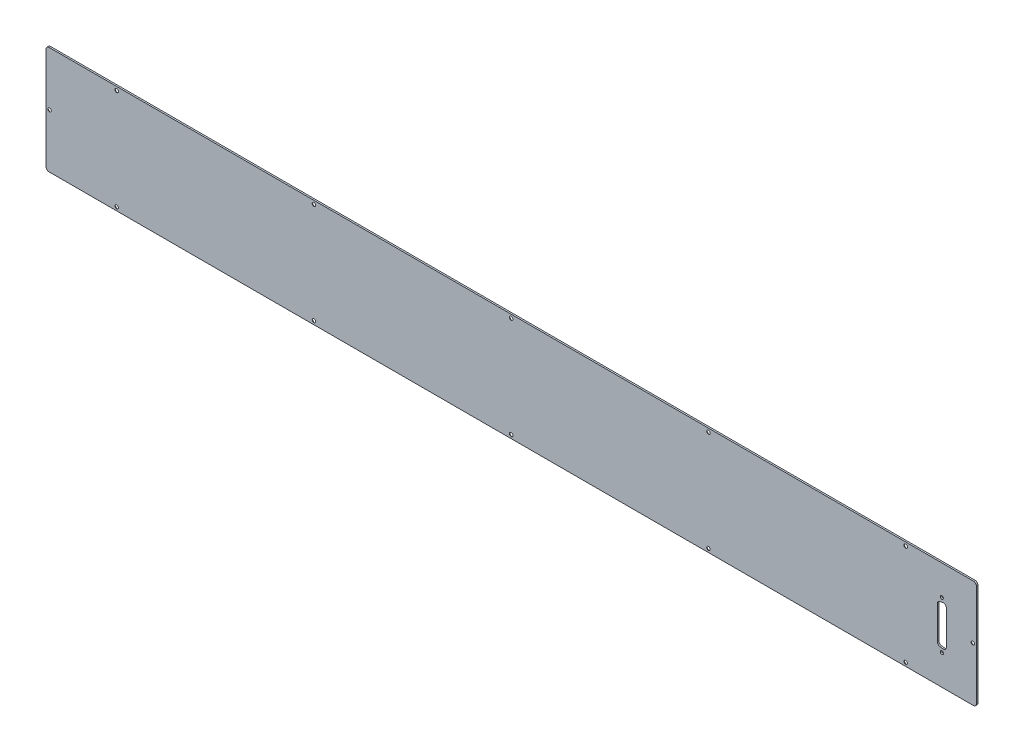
from build123d import *

# Parameters (mm, degrees)
SKETCH1_W                                      = 915
SKETCH1_H                                      = 106
BOSS_EXTRUDE1_DEPTH                            = 1.5748
FILLET1_R                                      = 3
CSK_FOR_M3_FLAT_HEAD_MACHINE_SCREW1_AT_2_COUNT = 2
CSK_FOR_M3_FLAT_HEAD_MACHINE_SCREW1_AT_2_PITCH = 194
CSK_FOR_M3_FLAT_HEAD_MACHINE_SCREW1_AT_3_COUNT = 2
CSK_FOR_M3_FLAT_HEAD_MACHINE_SCREW1_AT_3_PITCH = 388
CSK_FOR_M3_FLAT_HEAD_MACHINE_SCREW1_AT_4_COUNT = 2
CSK_FOR_M3_FLAT_HEAD_MACHINE_SCREW1_AT_4_PITCH = 217.800367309
CSK_FOR_M3_FLAT_HEAD_MACHINE_SCREW1_AT_5_COUNT = 2
CSK_FOR_M3_FLAT_HEAD_MACHINE_SCREW1_AT_5_PITCH = 99
CSK_FOR_M3_FLAT_HEAD_MACHINE_SCREW1_AT_6_COUNT = 2
CSK_FOR_M3_FLAT_HEAD_MACHINE_SCREW1_AT_6_PITCH = 400.43101778
CSK_FOR_M3_FLAT_HEAD_MACHINE_SCREW1_AT_7_COUNT = 2
CSK_FOR_M3_FLAT_HEAD_MACHINE_SCREW1_AT_7_PITCH = 782.289588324
CSK_FOR_M3_FLAT_HEAD_MACHINE_SCREW1_AT_8_COUNT = 2
CSK_FOR_M3_FLAT_HEAD_MACHINE_SCREW1_AT_8_PITCH = 776
CSK_FOR_M3_FLAT_HEAD_MACHINE_SCREW1_AT_9_COUNT = 2
CSK_FOR_M3_FLAT_HEAD_MACHINE_SCREW1_AT_9_PITCH = 582
CSK_FOR_M3_FLAT_HEAD_MACHINE_SCREW1_AT_1_COUNT = 2
CSK_FOR_M3_FLAT_HEAD_MACHINE_SCREW1_AT_1_PITCH = 590.360059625
CSK_FOR_M3_FLAT_HEAD_MACHINE_SCREW1_2_COUNT    = 2
CSK_FOR_M3_FLAT_HEAD_MACHINE_SCREW1_2_PITCH    = 82.5
CSK_FOR_M3_FLAT_HEAD_MACHINE_SCREW1_3_COUNT    = 2
CSK_FOR_M3_FLAT_HEAD_MACHINE_SCREW1_3_PITCH    = 843.453762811
SKETCH9_R                                      = 1.55
CUT_EXTRUDE1_DEPTH                             = 461.562406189


with BuildPart() as part:
    # Sketch1 → Boss-Extrude1 (new body)
    with BuildSketch(Plane.XY):
        Rectangle(SKETCH1_W, SKETCH1_H)
    extrude(amount=BOSS_EXTRUDE1_DEPTH)

    # Fillet1
    fillet1_edges = [part.edges().sort_by_distance(p)[0] for p in [
        (457.5, -53, 0.7874),
        (-457.5, -53, 0.7874),
        (-457.5, 53, 0.7874),
        (457.5, 53, 0.7874),
    ]]
    fillet(fillet1_edges, radius=FILLET1_R)

    # Sketch4 → CSK for M3 Flat Head Machine Screw1 (revolve, cut)
    with BuildSketch(Plane(origin=(-388, 49.5, 0), x_dir=(0, 1, 0), z_dir=(1, 0, 0))):
        Polygon((0, 0), (0, 1.5748), (1.7, 1.5748), (1.7, 1.45), (3.15, 0), align=None)
    csk_for_m3_flat_head_machine_screw1 = revolve(axis=Axis((-388, 49.5, -6.35), (0, 0, 1)), mode=Mode.SUBTRACT)

    # CSK for M3 Flat Head Machine Screw1 at 2: CSK for M3 Flat Head Machine Screw1 ×2
    with Locations(*[(i * CSK_FOR_M3_FLAT_HEAD_MACHINE_SCREW1_AT_2_PITCH, 0, 0) for i in range(1, CSK_FOR_M3_FLAT_HEAD_MACHINE_SCREW1_AT_2_COUNT)]):
        add(csk_for_m3_flat_head_machine_screw1, mode=Mode.SUBTRACT)

    # CSK for M3 Flat Head Machine Screw1 at 3: CSK for M3 Flat Head Machine Screw1 ×2
    with Locations(*[(i * CSK_FOR_M3_FLAT_HEAD_MACHINE_SCREW1_AT_3_PITCH, 0, 0) for i in range(1, CSK_FOR_M3_FLAT_HEAD_MACHINE_SCREW1_AT_3_COUNT)]):
        add(csk_for_m3_flat_head_machine_screw1, mode=Mode.SUBTRACT)

    # CSK for M3 Flat Head Machine Screw1 at 4: CSK for M3 Flat Head Machine Screw1 ×2
    with Locations(*[Vector(0.8907239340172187, -0.4545446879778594, 0) * (i * CSK_FOR_M3_FLAT_HEAD_MACHINE_SCREW1_AT_4_PITCH) for i in range(1, CSK_FOR_M3_FLAT_HEAD_MACHINE_SCREW1_AT_4_COUNT)]):
        add(csk_for_m3_flat_head_machine_screw1, mode=Mode.SUBTRACT)

    # CSK for M3 Flat Head Machine Screw1 at 5: CSK for M3 Flat Head Machine Screw1 ×2
    with Locations(*[(0, -i * CSK_FOR_M3_FLAT_HEAD_MACHINE_SCREW1_AT_5_PITCH, 0) for i in range(1, CSK_FOR_M3_FLAT_HEAD_MACHINE_SCREW1_AT_5_COUNT)]):
        add(csk_for_m3_flat_head_machine_screw1, mode=Mode.SUBTRACT)

    # CSK for M3 Flat Head Machine Screw1 at 6: CSK for M3 Flat Head Machine Screw1 ×2
    with Locations(*[Vector(0.968955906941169, -0.2472335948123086, 0) * (i * CSK_FOR_M3_FLAT_HEAD_MACHINE_SCREW1_AT_6_PITCH) for i in range(1, CSK_FOR_M3_FLAT_HEAD_MACHINE_SCREW1_AT_6_COUNT)]):
        add(csk_for_m3_flat_head_machine_screw1, mode=Mode.SUBTRACT)

    # CSK for M3 Flat Head Machine Screw1 at 7: CSK for M3 Flat Head Machine Screw1 ×2
    with Locations(*[Vector(0.9919600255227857, -0.12655160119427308, 0) * (i * CSK_FOR_M3_FLAT_HEAD_MACHINE_SCREW1_AT_7_PITCH) for i in range(1, CSK_FOR_M3_FLAT_HEAD_MACHINE_SCREW1_AT_7_COUNT)]):
        add(csk_for_m3_flat_head_machine_screw1, mode=Mode.SUBTRACT)

    # CSK for M3 Flat Head Machine Screw1 at 8: CSK for M3 Flat Head Machine Screw1 ×2
    with Locations(*[(i * CSK_FOR_M3_FLAT_HEAD_MACHINE_SCREW1_AT_8_PITCH, 0, 0) for i in range(1, CSK_FOR_M3_FLAT_HEAD_MACHINE_SCREW1_AT_8_COUNT)]):
        add(csk_for_m3_flat_head_machine_screw1, mode=Mode.SUBTRACT)

    # CSK for M3 Flat Head Machine Screw1 at 9: CSK for M3 Flat Head Machine Screw1 ×2
    with Locations(*[(i * CSK_FOR_M3_FLAT_HEAD_MACHINE_SCREW1_AT_9_PITCH, 0, 0) for i in range(1, CSK_FOR_M3_FLAT_HEAD_MACHINE_SCREW1_AT_9_COUNT)]):
        add(csk_for_m3_flat_head_machine_screw1, mode=Mode.SUBTRACT)

    # CSK for M3 Flat Head Machine Screw1 at 1: CSK for M3 Flat Head Machine Screw1 ×2
    with Locations(*[Vector(0.9858390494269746, -0.1676942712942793, 0) * (i * CSK_FOR_M3_FLAT_HEAD_MACHINE_SCREW1_AT_1_PITCH) for i in range(1, CSK_FOR_M3_FLAT_HEAD_MACHINE_SCREW1_AT_1_COUNT)]):
        add(csk_for_m3_flat_head_machine_screw1, mode=Mode.SUBTRACT)

    # CSK for M3 Flat Head Machine Screw1  2: CSK for M3 Flat Head Machine Screw1 ×2
    with Locations(*[Vector(-0.7999999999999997, -0.6000000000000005, 0) * (i * CSK_FOR_M3_FLAT_HEAD_MACHINE_SCREW1_2_PITCH) for i in range(1, CSK_FOR_M3_FLAT_HEAD_MACHINE_SCREW1_2_COUNT)]):
        add(csk_for_m3_flat_head_machine_screw1, mode=Mode.SUBTRACT)

    # CSK for M3 Flat Head Machine Screw1  3: CSK for M3 Flat Head Machine Screw1 ×2
    with Locations(*[Vector(0.99827641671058, -0.05868727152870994, 0) * (i * CSK_FOR_M3_FLAT_HEAD_MACHINE_SCREW1_3_PITCH) for i in range(1, CSK_FOR_M3_FLAT_HEAD_MACHINE_SCREW1_3_COUNT)]):
        add(csk_for_m3_flat_head_machine_screw1, mode=Mode.SUBTRACT)

    # Sketch9 → Cut-Extrude1 (cut, through all)
    with BuildSketch(Plane(origin=(0, 0, 0), x_dir=(-1, 0, 0), z_dir=(0, 0, -1))):
        with Locations((-423.5, 23.5)):
            Circle(SKETCH9_R)
        with Locations(Location((-423.5, -23.5, 0), (0, 0, 180))):
            Circle(SKETCH9_R)
        with BuildLine():
            Line((-427.95, -16.738), (-427.95, 16.738))
            ThreePointArc((-427.95, 16.738), (-426.878362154, 19.036133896), (-424.429053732, 19.692422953))
            Line((-424.429053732, 19.692422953), (-421.529053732, 19.181072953))
            ThreePointArc((-421.529053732, 19.181072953), (-419.751866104, 18.155012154), (-419.05, 16.22665))
            Line((-419.05, 16.22665), (-419.05, -16.22665))
            ThreePointArc((-419.05, -16.22665), (-419.751866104, -18.155012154), (-421.529053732, -19.181072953))
            Line((-421.529053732, -19.181072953), (-424.429053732, -19.692422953))
            ThreePointArc((-424.429053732, -19.692422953), (-426.878362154, -19.036133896), (-427.95, -16.738))
        make_face()
    extrude(amount=-CUT_EXTRUDE1_DEPTH, mode=Mode.SUBTRACT)


solid = part.part
